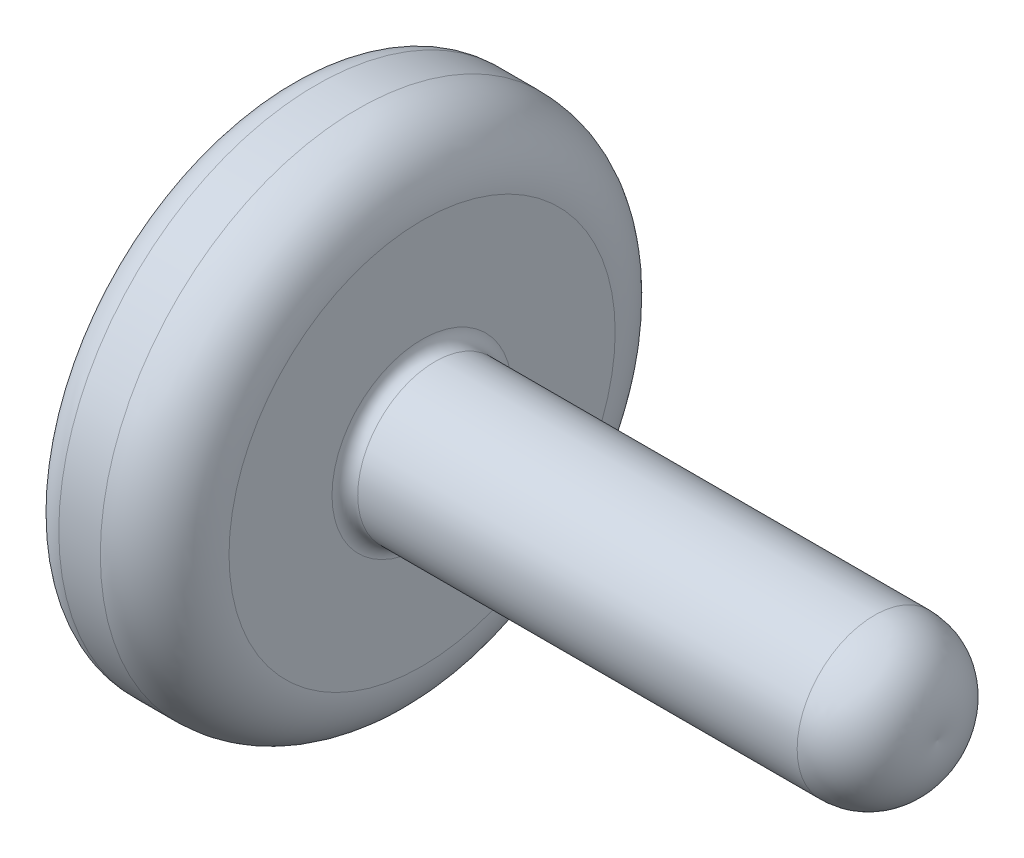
from build123d import *

# Parameters (mm, degrees)
FILLET1_R    = 0.1
RECPAT_COUNT = 2
RECPAT_ANGLE = 90


with BuildPart() as part:
    # BodySke → Base-Revolve (revolve)
    with BuildSketch(Plane.XY, mode=Mode.PRIVATE) as base_revolve_sk:
        with BuildLine():
            Line((1.5, 0.6), (1.5, 1.5))
            ThreePointArc((1.5, 1.5), (1.353553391, 1.853553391), (1, 2))
            Line((1, 2), (0.677350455, 2))
            ThreePointArc((0.677350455, 2), (0.553579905, 1.96562308), (0.465266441, 1.872340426))
            ThreePointArc((0.465266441, 1.872340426), (0.118058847, 0.964641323), (0, 0))
            Line((0, 0), (5.5, 0))
            ThreePointArc((5.5, 0), (5.39985093, 0.415913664), (5.013682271, 0.6))
            Line((5.013682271, 0.6), (1.5, 0.6))
        make_face()
    revolve(base_revolve_sk.sketch.rotate(Axis((5.013682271, 0, 0), (1, 0, 0)), 90), axis=Axis((5.013682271, 0, 0), (1, 0, 0)))

    # Fillet1
    fillet1_edges = [part.edges().sort_by_distance(p)[0] for p in [
        (1.5, 0, -0.6),
    ]]
    fillet(fillet1_edges, radius=FILLET1_R)

    # Sketch3 → Recess section 0
    with BuildSketch(Plane(origin=(0, 0, 0), x_dir=(0, 0, -1), z_dir=(1, 0, 0))):
        with BuildLine():
            Line((0.37, -1.3), (-0.37, -1.3))
            Line((-0.37, -1.3), (-0.37, 1.3))
            Line((-0.37, 1.3), (0.37, 1.3))
            Line((0.37, 1.3), (0.37, -1.3))
        make_face()
    # Sketch4 → Recess section 1
    with BuildSketch(Plane(origin=(1.5, 0, 0), x_dir=(0, 0, -1), z_dir=(1, 0, 0))):
        with BuildLine():
            Line((0.37, -0.552127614), (-0.37, -0.552127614))
            Line((-0.37, -0.552127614), (-0.37, 0.552127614))
            Line((-0.37, 0.552127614), (0.37, 0.552127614))
            Line((0.37, 0.552127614), (0.37, -0.552127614))
        make_face()
    recess = loft(mode=Mode.SUBTRACT)

    # RecPat: Recess ×2 about axis
    recpat_axis = Axis((0, 0, 0), (1, 0, 0))
    for i in range(1, RECPAT_COUNT):
        add(recess.rotate(recpat_axis, i * RECPAT_ANGLE / (RECPAT_COUNT - 1)), mode=Mode.SUBTRACT)

    # RecCorSke → RecessCore (revolve, cut)
    with BuildSketch(Plane.XY, mode=Mode.PRIVATE) as recesscore_sk:
        Polygon((0, 0), (0, 0.660890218), (1.5, 0.556), (1.680655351, 0), align=None)
    revolve(recesscore_sk.sketch.rotate(Axis((-3.175, 0, 0), (1, 0, 0)), 17.145865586), axis=Axis((-3.175, 0, 0), (1, 0, 0)), mode=Mode.SUBTRACT)


solid = part.part
